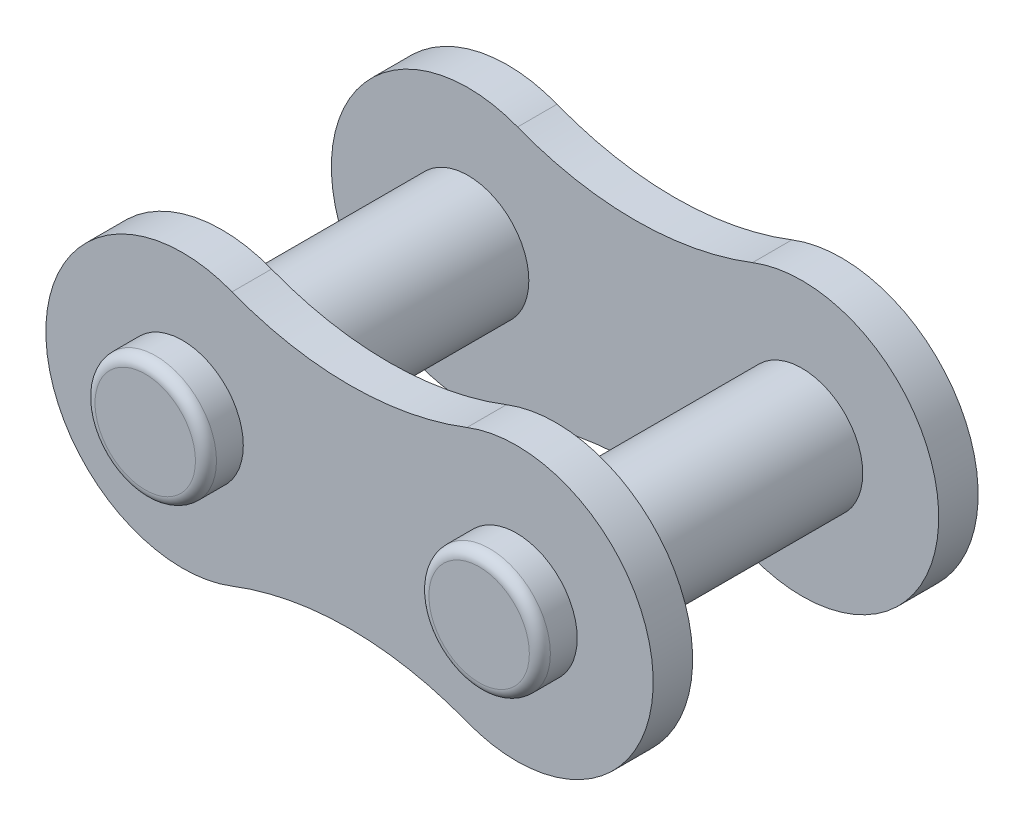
ISO-10303-21;
HEADER;
FILE_DESCRIPTION(('STEP AP214'),'2;1');
FILE_NAME('part.step','',(''),(''),'','','');
FILE_SCHEMA(('AUTOMOTIVE_DESIGN { 1 0 10303 214 1 1 1 1 }'));
ENDSEC;
DATA;
#1=APPLICATION_CONTEXT('core data for automotive mechanical design processes');
#2=APPLICATION_PROTOCOL_DEFINITION('international standard','automotive_design',2000,#1);
#3=PRODUCT_CONTEXT('',#1,'mechanical');
#4=PRODUCT('Part','Part','',(#3));
#5=PRODUCT_RELATED_PRODUCT_CATEGORY('part','',(#4));
#6=PRODUCT_DEFINITION_FORMATION('','',#4);
#7=PRODUCT_DEFINITION_CONTEXT('part definition',#1,'design');
#8=PRODUCT_DEFINITION('design','',#6,#7);
#9=PRODUCT_DEFINITION_SHAPE('','',#8);
#10=(LENGTH_UNIT() NAMED_UNIT(*) SI_UNIT(.MILLI.,.METRE.));
#11=(NAMED_UNIT(*) PLANE_ANGLE_UNIT() SI_UNIT($,.RADIAN.));
#12=(NAMED_UNIT(*) SI_UNIT($,.STERADIAN.) SOLID_ANGLE_UNIT());
#13=UNCERTAINTY_MEASURE_WITH_UNIT(LENGTH_MEASURE(1.E-05),#10,'distance_accuracy_value','');
#14=(GEOMETRIC_REPRESENTATION_CONTEXT(3) GLOBAL_UNCERTAINTY_ASSIGNED_CONTEXT((#13)) GLOBAL_UNIT_ASSIGNED_CONTEXT((#10,
#11,#12)) REPRESENTATION_CONTEXT('',''));
#15=CARTESIAN_POINT('',(0.,0.,0.));
#16=DIRECTION('',(0.,0.,1.));
#17=DIRECTION('',(1.,0.,0.));
#18=AXIS2_PLACEMENT_3D('',#15,#16,#17);
#19=CARTESIAN_POINT('',(3.175,8.17510091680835,3.09));
#20=DIRECTION('',(0.,0.,-1.));
#21=DIRECTION('',(-1.,0.,0.));
#22=AXIS2_PLACEMENT_3D('',#19,#20,#21);
#23=CYLINDRICAL_SURFACE('',#22,6.17);
#24=CARTESIAN_POINT('',(3.175,8.17510091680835,2.34));
#25=DIRECTION('',(0.,0.,1.));
#26=DIRECTION('',(-0.362029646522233,-0.932166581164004,0.));
#27=AXIS2_PLACEMENT_3D('',#24,#25,#26);
#28=CIRCLE('',#27,6.17);
#29=CARTESIAN_POINT('',(0.94127708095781,2.4236331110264,2.34));
#30=VERTEX_POINT('',#29);
#31=CARTESIAN_POINT('',(5.4087229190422,2.4236331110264,2.34));
#32=VERTEX_POINT('',#31);
#33=EDGE_CURVE('E90',#30,#32,#28,.T.);
#34=ORIENTED_EDGE('',*,*,#33,.F.);
#35=DIRECTION('',(0.,0.,-1.));
#36=VECTOR('',#35,1.);
#37=CARTESIAN_POINT('',(0.94127708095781,2.4236331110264,3.09));
#38=LINE('',#37,#36);
#39=CARTESIAN_POINT('',(0.94127708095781,2.4236331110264,3.09));
#40=VERTEX_POINT('',#39);
#41=EDGE_CURVE('E79',#40,#30,#38,.T.);
#42=ORIENTED_EDGE('',*,*,#41,.F.);
#43=CARTESIAN_POINT('',(3.175,8.17510091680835,3.09));
#44=DIRECTION('',(0.,0.,1.));
#45=DIRECTION('',(-0.362029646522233,-0.932166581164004,0.));
#46=AXIS2_PLACEMENT_3D('',#43,#44,#45);
#47=CIRCLE('',#46,6.17);
#48=CARTESIAN_POINT('',(5.4087229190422,2.4236331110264,3.09));
#49=VERTEX_POINT('',#48);
#50=EDGE_CURVE('E89',#40,#49,#47,.T.);
#51=ORIENTED_EDGE('',*,*,#50,.T.);
#52=DIRECTION('',(0.,0.,-1.));
#53=VECTOR('',#52,1.);
#54=CARTESIAN_POINT('',(5.4087229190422,2.4236331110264,3.09));
#55=LINE('',#54,#53);
#56=EDGE_CURVE('E101',#49,#32,#55,.T.);
#57=ORIENTED_EDGE('',*,*,#56,.T.);
#58=EDGE_LOOP('',(#34,#42,#51,#57));
#59=FACE_BOUND('',#58,.T.);
#60=ADVANCED_FACE('F15',(#59),#23,.F.);
#61=CARTESIAN_POINT('',(4.7625,4.08755045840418,2.34));
#62=DIRECTION('',(0.,0.,1.));
#63=DIRECTION('',(1.,0.,0.));
#64=AXIS2_PLACEMENT_3D('',#61,#62,#63);
#65=PLANE('',#64);
#66=CARTESIAN_POINT('',(6.35,0.,2.34));
#67=DIRECTION('',(0.,0.,-1.));
#68=DIRECTION('',(1.,0.,0.));
#69=AXIS2_PLACEMENT_3D('',#66,#67,#68);
#70=CIRCLE('',#69,1.155);
#71=CARTESIAN_POINT('',(7.505,0.,2.34));
#72=VERTEX_POINT('',#71);
#73=EDGE_CURVE('E112',#72,#72,#70,.T.);
#74=ORIENTED_EDGE('',*,*,#73,.F.);
#75=EDGE_LOOP('',(#74));
#76=FACE_BOUND('',#75,.T.);
#77=CARTESIAN_POINT('',(0.,0.,2.34));
#78=DIRECTION('',(0.,0.,-1.));
#79=DIRECTION('',(1.,0.,0.));
#80=AXIS2_PLACEMENT_3D('',#77,#78,#79);
#81=CIRCLE('',#80,1.155);
#82=CARTESIAN_POINT('',(1.155,0.,2.34));
#83=VERTEX_POINT('',#82);
#84=EDGE_CURVE('E117',#83,#83,#81,.T.);
#85=ORIENTED_EDGE('',*,*,#84,.F.);
#86=EDGE_LOOP('',(#85));
#87=FACE_BOUND('',#86,.T.);
#88=ORIENTED_EDGE('',*,*,#33,.T.);
#89=CARTESIAN_POINT('',(6.35,0.,2.34));
#90=DIRECTION('',(0.,0.,1.));
#91=DIRECTION('',(-0.362029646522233,-0.932166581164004,0.));
#92=AXIS2_PLACEMENT_3D('',#89,#90,#91);
#93=CIRCLE('',#92,2.6);
#94=CARTESIAN_POINT('',(5.4087229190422,-2.4236331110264,2.34));
#95=VERTEX_POINT('',#94);
#96=EDGE_CURVE('E120',#95,#32,#93,.T.);
#97=ORIENTED_EDGE('',*,*,#96,.F.);
#98=CARTESIAN_POINT('',(3.17500000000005,-8.17510091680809,2.34));
#99=DIRECTION('',(0.,0.,1.));
#100=DIRECTION('',(0.36202964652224,0.932166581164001,0.));
#101=AXIS2_PLACEMENT_3D('',#98,#99,#100);
#102=CIRCLE('',#101,6.16999999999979);
#103=CARTESIAN_POINT('',(0.941276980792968,-2.4236331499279,2.34));
#104=VERTEX_POINT('',#103);
#105=EDGE_CURVE('E97',#95,#104,#102,.T.);
#106=ORIENTED_EDGE('',*,*,#105,.T.);
#107=CARTESIAN_POINT('',(0.,0.,2.34));
#108=DIRECTION('',(0.,0.,1.));
#109=DIRECTION('',(0.36202964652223,0.932166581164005,0.));
#110=AXIS2_PLACEMENT_3D('',#107,#108,#109);
#111=CIRCLE('',#110,2.6);
#112=EDGE_CURVE('E83',#30,#104,#111,.T.);
#113=ORIENTED_EDGE('',*,*,#112,.F.);
#114=EDGE_LOOP('',(#88,#97,#106,#113));
#115=FACE_BOUND('',#114,.T.);
#116=ADVANCED_FACE('F95',(#76,#87,#115),#65,.F.);
#117=CARTESIAN_POINT('',(0.,0.,3.09));
#118=DIRECTION('',(0.,0.,-1.));
#119=DIRECTION('',(-1.,0.,0.));
#120=AXIS2_PLACEMENT_3D('',#117,#118,#119);
#121=CYLINDRICAL_SURFACE('',#120,2.6);
#122=ORIENTED_EDGE('',*,*,#112,.T.);
#123=DIRECTION('',(0.,0.,-1.));
#124=VECTOR('',#123,1.);
#125=CARTESIAN_POINT('',(0.941276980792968,-2.4236331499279,3.09));
#126=LINE('',#125,#124);
#127=CARTESIAN_POINT('',(0.941276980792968,-2.4236331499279,3.09));
#128=VERTEX_POINT('',#127);
#129=EDGE_CURVE('E98',#128,#104,#126,.T.);
#130=ORIENTED_EDGE('',*,*,#129,.F.);
#131=CARTESIAN_POINT('',(0.,0.,3.09));
#132=DIRECTION('',(0.,0.,1.));
#133=DIRECTION('',(0.36202964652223,0.932166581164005,0.));
#134=AXIS2_PLACEMENT_3D('',#131,#132,#133);
#135=CIRCLE('',#134,2.6);
#136=EDGE_CURVE('E85',#40,#128,#135,.T.);
#137=ORIENTED_EDGE('',*,*,#136,.F.);
#138=ORIENTED_EDGE('',*,*,#41,.T.);
#139=EDGE_LOOP('',(#122,#130,#137,#138));
#140=FACE_BOUND('',#139,.T.);
#141=ADVANCED_FACE('F81',(#140),#121,.T.);
#142=CARTESIAN_POINT('',(4.7625,4.08755045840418,3.09));
#143=DIRECTION('',(0.,0.,1.));
#144=DIRECTION('',(1.,0.,0.));
#145=AXIS2_PLACEMENT_3D('',#142,#143,#144);
#146=PLANE('',#145);
#147=CARTESIAN_POINT('',(6.35,0.,3.09));
#148=DIRECTION('',(0.,0.,-1.));
#149=DIRECTION('',(1.,0.,0.));
#150=AXIS2_PLACEMENT_3D('',#147,#148,#149);
#151=CIRCLE('',#150,1.155);
#152=CARTESIAN_POINT('',(7.505,0.,3.09));
#153=VERTEX_POINT('',#152);
#154=EDGE_CURVE('E133',#153,#153,#151,.T.);
#155=ORIENTED_EDGE('',*,*,#154,.T.);
#156=EDGE_LOOP('',(#155));
#157=FACE_BOUND('',#156,.T.);
#158=CARTESIAN_POINT('',(0.,0.,3.09));
#159=DIRECTION('',(0.,0.,-1.));
#160=DIRECTION('',(1.,0.,0.));
#161=AXIS2_PLACEMENT_3D('',#158,#159,#160);
#162=CIRCLE('',#161,1.155);
#163=CARTESIAN_POINT('',(1.155,0.,3.09));
#164=VERTEX_POINT('',#163);
#165=EDGE_CURVE('E138',#164,#164,#162,.T.);
#166=ORIENTED_EDGE('',*,*,#165,.T.);
#167=EDGE_LOOP('',(#166));
#168=FACE_BOUND('',#167,.T.);
#169=ORIENTED_EDGE('',*,*,#50,.F.);
#170=ORIENTED_EDGE('',*,*,#136,.T.);
#171=CARTESIAN_POINT('',(3.17500000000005,-8.17510091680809,3.09));
#172=DIRECTION('',(0.,0.,1.));
#173=DIRECTION('',(0.36202964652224,0.932166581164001,0.));
#174=AXIS2_PLACEMENT_3D('',#171,#172,#173);
#175=CIRCLE('',#174,6.16999999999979);
#176=CARTESIAN_POINT('',(5.4087229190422,-2.4236331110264,3.09));
#177=VERTEX_POINT('',#176);
#178=EDGE_CURVE('E141',#177,#128,#175,.T.);
#179=ORIENTED_EDGE('',*,*,#178,.F.);
#180=CARTESIAN_POINT('',(6.35,0.,3.09));
#181=DIRECTION('',(0.,0.,1.));
#182=DIRECTION('',(-0.362029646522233,-0.932166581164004,0.));
#183=AXIS2_PLACEMENT_3D('',#180,#181,#182);
#184=CIRCLE('',#183,2.6);
#185=EDGE_CURVE('E143',#177,#49,#184,.T.);
#186=ORIENTED_EDGE('',*,*,#185,.T.);
#187=EDGE_LOOP('',(#169,#170,#179,#186));
#188=FACE_BOUND('',#187,.T.);
#189=ADVANCED_FACE('F263',(#157,#168,#188),#146,.T.);
#190=CARTESIAN_POINT('',(6.35,0.,3.09));
#191=DIRECTION('',(0.,0.,-1.));
#192=DIRECTION('',(-1.,0.,0.));
#193=AXIS2_PLACEMENT_3D('',#190,#191,#192);
#194=CYLINDRICAL_SURFACE('',#193,2.6);
#195=ORIENTED_EDGE('',*,*,#96,.T.);
#196=ORIENTED_EDGE('',*,*,#56,.F.);
#197=ORIENTED_EDGE('',*,*,#185,.F.);
#198=DIRECTION('',(0.,0.,-1.));
#199=VECTOR('',#198,1.);
#200=CARTESIAN_POINT('',(5.4087229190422,-2.4236331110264,3.09));
#201=LINE('',#200,#199);
#202=EDGE_CURVE('E148',#177,#95,#201,.T.);
#203=ORIENTED_EDGE('',*,*,#202,.T.);
#204=EDGE_LOOP('',(#195,#196,#197,#203));
#205=FACE_BOUND('',#204,.T.);
#206=ADVANCED_FACE('F266',(#205),#194,.T.);
#207=CARTESIAN_POINT('',(6.35,0.,3.8));
#208=DIRECTION('',(0.,0.,1.));
#209=DIRECTION('',(1.,0.,0.));
#210=AXIS2_PLACEMENT_3D('',#207,#208,#209);
#211=CYLINDRICAL_SURFACE('',#210,1.155);
#212=ORIENTED_EDGE('',*,*,#73,.T.);
#213=EDGE_LOOP('',(#212));
#214=FACE_BOUND('',#213,.T.);
#215=CARTESIAN_POINT('',(6.35,0.,-2.34));
#216=DIRECTION('',(0.,0.,1.));
#217=DIRECTION('',(1.,0.,0.));
#218=AXIS2_PLACEMENT_3D('',#215,#216,#217);
#219=CIRCLE('',#218,1.155);
#220=CARTESIAN_POINT('',(7.505,0.,-2.34));
#221=VERTEX_POINT('',#220);
#222=EDGE_CURVE('E153',#221,#221,#219,.T.);
#223=ORIENTED_EDGE('',*,*,#222,.T.);
#224=EDGE_LOOP('',(#223));
#225=FACE_BOUND('',#224,.T.);
#226=ADVANCED_FACE('F270',(#214,#225),#211,.T.);
#227=CARTESIAN_POINT('',(0.,0.,3.8));
#228=DIRECTION('',(0.,0.,1.));
#229=DIRECTION('',(1.,0.,0.));
#230=AXIS2_PLACEMENT_3D('',#227,#228,#229);
#231=CYLINDRICAL_SURFACE('',#230,1.155);
#232=ORIENTED_EDGE('',*,*,#84,.T.);
#233=EDGE_LOOP('',(#232));
#234=FACE_BOUND('',#233,.T.);
#235=CARTESIAN_POINT('',(0.,0.,-2.34));
#236=DIRECTION('',(0.,0.,1.));
#237=DIRECTION('',(1.,0.,0.));
#238=AXIS2_PLACEMENT_3D('',#235,#236,#237);
#239=CIRCLE('',#238,1.155);
#240=CARTESIAN_POINT('',(1.155,0.,-2.34));
#241=VERTEX_POINT('',#240);
#242=EDGE_CURVE('E158',#241,#241,#239,.T.);
#243=ORIENTED_EDGE('',*,*,#242,.T.);
#244=EDGE_LOOP('',(#243));
#245=FACE_BOUND('',#244,.T.);
#246=ADVANCED_FACE('F274',(#234,#245),#231,.T.);
#247=CARTESIAN_POINT('',(3.17500000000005,-8.17510091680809,3.09));
#248=DIRECTION('',(0.,0.,-1.));
#249=DIRECTION('',(-1.,0.,0.));
#250=AXIS2_PLACEMENT_3D('',#247,#248,#249);
#251=CYLINDRICAL_SURFACE('',#250,6.16999999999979);
#252=ORIENTED_EDGE('',*,*,#105,.F.);
#253=ORIENTED_EDGE('',*,*,#202,.F.);
#254=ORIENTED_EDGE('',*,*,#178,.T.);
#255=ORIENTED_EDGE('',*,*,#129,.T.);
#256=EDGE_LOOP('',(#252,#253,#254,#255));
#257=FACE_BOUND('',#256,.T.);
#258=ADVANCED_FACE('F280',(#257),#251,.F.);
#259=CARTESIAN_POINT('',(6.35,0.,3.6));
#260=DIRECTION('',(0.,0.,1.));
#261=DIRECTION('',(1.,0.,0.));
#262=AXIS2_PLACEMENT_3D('',#259,#260,#261);
#263=CIRCLE('',#262,1.155);
#264=CARTESIAN_POINT('',(7.505,0.,3.6));
#265=VERTEX_POINT('',#264);
#266=EDGE_CURVE('E161',#265,#265,#263,.T.);
#267=ORIENTED_EDGE('',*,*,#266,.F.);
#268=EDGE_LOOP('',(#267));
#269=FACE_BOUND('',#268,.T.);
#270=ORIENTED_EDGE('',*,*,#154,.F.);
#271=EDGE_LOOP('',(#270));
#272=FACE_BOUND('',#271,.T.);
#273=ADVANCED_FACE('F277',(#269,#272),#211,.T.);
#274=CARTESIAN_POINT('',(0.,0.,3.6));
#275=DIRECTION('',(0.,0.,1.));
#276=DIRECTION('',(1.,0.,0.));
#277=AXIS2_PLACEMENT_3D('',#274,#275,#276);
#278=CIRCLE('',#277,1.155);
#279=CARTESIAN_POINT('',(1.155,0.,3.6));
#280=VERTEX_POINT('',#279);
#281=EDGE_CURVE('E164',#280,#280,#278,.T.);
#282=ORIENTED_EDGE('',*,*,#281,.F.);
#283=EDGE_LOOP('',(#282));
#284=FACE_BOUND('',#283,.T.);
#285=ORIENTED_EDGE('',*,*,#165,.F.);
#286=EDGE_LOOP('',(#285));
#287=FACE_BOUND('',#286,.T.);
#288=ADVANCED_FACE('F283',(#284,#287),#231,.T.);
#289=CARTESIAN_POINT('',(4.7625,4.08755045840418,-2.34));
#290=DIRECTION('',(0.,0.,1.));
#291=DIRECTION('',(1.,0.,0.));
#292=AXIS2_PLACEMENT_3D('',#289,#290,#291);
#293=PLANE('',#292);
#294=ORIENTED_EDGE('',*,*,#242,.F.);
#295=EDGE_LOOP('',(#294));
#296=FACE_BOUND('',#295,.T.);
#297=ORIENTED_EDGE('',*,*,#222,.F.);
#298=EDGE_LOOP('',(#297));
#299=FACE_BOUND('',#298,.T.);
#300=CARTESIAN_POINT('',(3.175,8.17510091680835,-2.34));
#301=DIRECTION('',(0.,0.,1.));
#302=DIRECTION('',(-0.362029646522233,-0.932166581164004,0.));
#303=AXIS2_PLACEMENT_3D('',#300,#301,#302);
#304=CIRCLE('',#303,6.17);
#305=CARTESIAN_POINT('',(0.94127708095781,2.4236331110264,-2.34));
#306=VERTEX_POINT('',#305);
#307=CARTESIAN_POINT('',(5.4087229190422,2.4236331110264,-2.34));
#308=VERTEX_POINT('',#307);
#309=EDGE_CURVE('E167',#306,#308,#304,.T.);
#310=ORIENTED_EDGE('',*,*,#309,.F.);
#311=CARTESIAN_POINT('',(0.,0.,-2.34));
#312=DIRECTION('',(0.,0.,1.));
#313=DIRECTION('',(0.36202964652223,0.932166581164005,0.));
#314=AXIS2_PLACEMENT_3D('',#311,#312,#313);
#315=CIRCLE('',#314,2.6);
#316=CARTESIAN_POINT('',(0.941276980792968,-2.4236331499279,-2.34));
#317=VERTEX_POINT('',#316);
#318=EDGE_CURVE('E170',#306,#317,#315,.T.);
#319=ORIENTED_EDGE('',*,*,#318,.T.);
#320=CARTESIAN_POINT('',(3.17500000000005,-8.17510091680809,-2.34));
#321=DIRECTION('',(0.,0.,1.));
#322=DIRECTION('',(0.36202964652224,0.932166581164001,0.));
#323=AXIS2_PLACEMENT_3D('',#320,#321,#322);
#324=CIRCLE('',#323,6.16999999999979);
#325=CARTESIAN_POINT('',(5.4087229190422,-2.4236331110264,-2.34));
#326=VERTEX_POINT('',#325);
#327=EDGE_CURVE('E175',#326,#317,#324,.T.);
#328=ORIENTED_EDGE('',*,*,#327,.F.);
#329=CARTESIAN_POINT('',(6.35,0.,-2.34));
#330=DIRECTION('',(0.,0.,1.));
#331=DIRECTION('',(-0.362029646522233,-0.932166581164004,0.));
#332=AXIS2_PLACEMENT_3D('',#329,#330,#331);
#333=CIRCLE('',#332,2.6);
#334=EDGE_CURVE('E179',#326,#308,#333,.T.);
#335=ORIENTED_EDGE('',*,*,#334,.T.);
#336=EDGE_LOOP('',(#310,#319,#328,#335));
#337=FACE_BOUND('',#336,.T.);
#338=ADVANCED_FACE('F287',(#296,#299,#337),#293,.T.);
#339=CARTESIAN_POINT('',(6.35,0.,3.6));
#340=DIRECTION('',(0.,0.,1.));
#341=DIRECTION('',(1.,0.,0.));
#342=AXIS2_PLACEMENT_3D('',#339,#340,#341);
#343=TOROIDAL_SURFACE('',#342,0.954999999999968,0.200000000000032);
#344=ORIENTED_EDGE('',*,*,#266,.T.);
#345=EDGE_LOOP('',(#344));
#346=FACE_BOUND('',#345,.T.);
#347=CARTESIAN_POINT('',(6.35,0.,3.8));
#348=DIRECTION('',(0.,0.,1.));
#349=DIRECTION('',(1.,0.,0.));
#350=AXIS2_PLACEMENT_3D('',#347,#348,#349);
#351=CIRCLE('',#350,0.955000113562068);
#352=CARTESIAN_POINT('',(7.30500011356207,0.,3.8));
#353=VERTEX_POINT('',#352);
#354=EDGE_CURVE('E184',#353,#353,#351,.T.);
#355=ORIENTED_EDGE('',*,*,#354,.F.);
#356=EDGE_LOOP('',(#355));
#357=FACE_BOUND('',#356,.T.);
#358=ADVANCED_FACE('F290',(#346,#357),#343,.T.);
#359=CARTESIAN_POINT('',(0.,0.,3.6));
#360=DIRECTION('',(0.,0.,1.));
#361=DIRECTION('',(1.,0.,0.));
#362=AXIS2_PLACEMENT_3D('',#359,#360,#361);
#363=TOROIDAL_SURFACE('',#362,0.954999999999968,0.200000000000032);
#364=ORIENTED_EDGE('',*,*,#281,.T.);
#365=EDGE_LOOP('',(#364));
#366=FACE_BOUND('',#365,.T.);
#367=CARTESIAN_POINT('',(0.,0.,3.8));
#368=DIRECTION('',(0.,0.,1.));
#369=DIRECTION('',(1.,0.,0.));
#370=AXIS2_PLACEMENT_3D('',#367,#368,#369);
#371=CIRCLE('',#370,0.955000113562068);
#372=CARTESIAN_POINT('',(0.955000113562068,0.,3.8));
#373=VERTEX_POINT('',#372);
#374=EDGE_CURVE('E189',#373,#373,#371,.T.);
#375=ORIENTED_EDGE('',*,*,#374,.F.);
#376=EDGE_LOOP('',(#375));
#377=FACE_BOUND('',#376,.T.);
#378=ADVANCED_FACE('F294',(#366,#377),#363,.T.);
#379=CARTESIAN_POINT('',(3.175,8.17510091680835,-3.09));
#380=DIRECTION('',(0.,0.,1.));
#381=DIRECTION('',(1.,0.,0.));
#382=AXIS2_PLACEMENT_3D('',#379,#380,#381);
#383=CYLINDRICAL_SURFACE('',#382,6.17);
#384=ORIENTED_EDGE('',*,*,#309,.T.);
#385=DIRECTION('',(0.,0.,1.));
#386=VECTOR('',#385,1.);
#387=CARTESIAN_POINT('',(5.4087229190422,2.4236331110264,-3.09));
#388=LINE('',#387,#386);
#389=CARTESIAN_POINT('',(5.4087229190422,2.4236331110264,-3.09));
#390=VERTEX_POINT('',#389);
#391=EDGE_CURVE('E192',#390,#308,#388,.T.);
#392=ORIENTED_EDGE('',*,*,#391,.F.);
#393=CARTESIAN_POINT('',(3.175,8.17510091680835,-3.09));
#394=DIRECTION('',(0.,0.,1.));
#395=DIRECTION('',(-0.362029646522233,-0.932166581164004,0.));
#396=AXIS2_PLACEMENT_3D('',#393,#394,#395);
#397=CIRCLE('',#396,6.17);
#398=CARTESIAN_POINT('',(0.94127708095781,2.4236331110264,-3.09));
#399=VERTEX_POINT('',#398);
#400=EDGE_CURVE('E194',#399,#390,#397,.T.);
#401=ORIENTED_EDGE('',*,*,#400,.F.);
#402=DIRECTION('',(0.,0.,1.));
#403=VECTOR('',#402,1.);
#404=CARTESIAN_POINT('',(0.94127708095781,2.4236331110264,-3.09));
#405=LINE('',#404,#403);
#406=EDGE_CURVE('E198',#399,#306,#405,.T.);
#407=ORIENTED_EDGE('',*,*,#406,.T.);
#408=EDGE_LOOP('',(#384,#392,#401,#407));
#409=FACE_BOUND('',#408,.T.);
#410=ADVANCED_FACE('F298',(#409),#383,.F.);
#411=CARTESIAN_POINT('',(0.,0.,-3.09));
#412=DIRECTION('',(0.,0.,1.));
#413=DIRECTION('',(1.,0.,0.));
#414=AXIS2_PLACEMENT_3D('',#411,#412,#413);
#415=CYLINDRICAL_SURFACE('',#414,2.6);
#416=ORIENTED_EDGE('',*,*,#318,.F.);
#417=ORIENTED_EDGE('',*,*,#406,.F.);
#418=CARTESIAN_POINT('',(0.,0.,-3.09));
#419=DIRECTION('',(0.,0.,1.));
#420=DIRECTION('',(0.36202964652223,0.932166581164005,0.));
#421=AXIS2_PLACEMENT_3D('',#418,#419,#420);
#422=CIRCLE('',#421,2.6);
#423=CARTESIAN_POINT('',(0.941276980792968,-2.4236331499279,-3.09));
#424=VERTEX_POINT('',#423);
#425=EDGE_CURVE('E203',#399,#424,#422,.T.);
#426=ORIENTED_EDGE('',*,*,#425,.T.);
#427=DIRECTION('',(0.,0.,1.));
#428=VECTOR('',#427,1.);
#429=CARTESIAN_POINT('',(0.941276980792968,-2.4236331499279,-3.09));
#430=LINE('',#429,#428);
#431=EDGE_CURVE('E207',#424,#317,#430,.T.);
#432=ORIENTED_EDGE('',*,*,#431,.T.);
#433=EDGE_LOOP('',(#416,#417,#426,#432));
#434=FACE_BOUND('',#433,.T.);
#435=ADVANCED_FACE('F302',(#434),#415,.T.);
#436=CARTESIAN_POINT('',(3.17500000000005,-8.17510091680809,-3.09));
#437=DIRECTION('',(0.,0.,1.));
#438=DIRECTION('',(1.,0.,0.));
#439=AXIS2_PLACEMENT_3D('',#436,#437,#438);
#440=CYLINDRICAL_SURFACE('',#439,6.16999999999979);
#441=ORIENTED_EDGE('',*,*,#327,.T.);
#442=ORIENTED_EDGE('',*,*,#431,.F.);
#443=CARTESIAN_POINT('',(3.17500000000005,-8.17510091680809,-3.09));
#444=DIRECTION('',(0.,0.,1.));
#445=DIRECTION('',(0.36202964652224,0.932166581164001,0.));
#446=AXIS2_PLACEMENT_3D('',#443,#444,#445);
#447=CIRCLE('',#446,6.16999999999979);
#448=CARTESIAN_POINT('',(5.4087229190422,-2.4236331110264,-3.09));
#449=VERTEX_POINT('',#448);
#450=EDGE_CURVE('E34',#449,#424,#447,.T.);
#451=ORIENTED_EDGE('',*,*,#450,.F.);
#452=DIRECTION('',(0.,0.,1.));
#453=VECTOR('',#452,1.);
#454=CARTESIAN_POINT('',(5.4087229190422,-2.4236331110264,-3.09));
#455=LINE('',#454,#453);
#456=EDGE_CURVE('E215',#449,#326,#455,.T.);
#457=ORIENTED_EDGE('',*,*,#456,.T.);
#458=EDGE_LOOP('',(#441,#442,#451,#457));
#459=FACE_BOUND('',#458,.T.);
#460=ADVANCED_FACE('F306',(#459),#440,.F.);
#461=CARTESIAN_POINT('',(6.35,0.,-3.09));
#462=DIRECTION('',(0.,0.,1.));
#463=DIRECTION('',(1.,0.,0.));
#464=AXIS2_PLACEMENT_3D('',#461,#462,#463);
#465=CYLINDRICAL_SURFACE('',#464,2.6);
#466=ORIENTED_EDGE('',*,*,#334,.F.);
#467=ORIENTED_EDGE('',*,*,#456,.F.);
#468=CARTESIAN_POINT('',(6.35,0.,-3.09));
#469=DIRECTION('',(0.,0.,1.));
#470=DIRECTION('',(-0.362029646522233,-0.932166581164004,0.));
#471=AXIS2_PLACEMENT_3D('',#468,#469,#470);
#472=CIRCLE('',#471,2.6);
#473=EDGE_CURVE('E30',#449,#390,#472,.T.);
#474=ORIENTED_EDGE('',*,*,#473,.T.);
#475=ORIENTED_EDGE('',*,*,#391,.T.);
#476=EDGE_LOOP('',(#466,#467,#474,#475));
#477=FACE_BOUND('',#476,.T.);
#478=ADVANCED_FACE('F310',(#477),#465,.T.);
#479=CARTESIAN_POINT('',(7.305,0.,3.8));
#480=DIRECTION('',(0.,0.,-1.));
#481=DIRECTION('',(-1.,0.,0.));
#482=AXIS2_PLACEMENT_3D('',#479,#480,#481);
#483=PLANE('',#482);
#484=ORIENTED_EDGE('',*,*,#354,.T.);
#485=EDGE_LOOP('',(#484));
#486=FACE_BOUND('',#485,.T.);
#487=ADVANCED_FACE('F314',(#486),#483,.F.);
#488=CARTESIAN_POINT('',(0.955,0.,3.8));
#489=DIRECTION('',(0.,0.,-1.));
#490=DIRECTION('',(-1.,0.,0.));
#491=AXIS2_PLACEMENT_3D('',#488,#489,#490);
#492=PLANE('',#491);
#493=ORIENTED_EDGE('',*,*,#374,.T.);
#494=EDGE_LOOP('',(#493));
#495=FACE_BOUND('',#494,.T.);
#496=ADVANCED_FACE('F318',(#495),#492,.F.);
#497=CARTESIAN_POINT('',(4.7625,4.08755045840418,-3.09));
#498=DIRECTION('',(0.,0.,1.));
#499=DIRECTION('',(1.,0.,0.));
#500=AXIS2_PLACEMENT_3D('',#497,#498,#499);
#501=PLANE('',#500);
#502=CARTESIAN_POINT('',(0.,0.,-3.09));
#503=DIRECTION('',(0.,0.,1.));
#504=DIRECTION('',(1.,0.,0.));
#505=AXIS2_PLACEMENT_3D('',#502,#503,#504);
#506=CIRCLE('',#505,1.155);
#507=CARTESIAN_POINT('',(1.155,0.,-3.09));
#508=VERTEX_POINT('',#507);
#509=EDGE_CURVE('E223',#508,#508,#506,.T.);
#510=ORIENTED_EDGE('',*,*,#509,.T.);
#511=EDGE_LOOP('',(#510));
#512=FACE_BOUND('',#511,.T.);
#513=CARTESIAN_POINT('',(6.35,0.,-3.09));
#514=DIRECTION('',(0.,0.,1.));
#515=DIRECTION('',(1.,0.,0.));
#516=AXIS2_PLACEMENT_3D('',#513,#514,#515);
#517=CIRCLE('',#516,1.155);
#518=CARTESIAN_POINT('',(7.505,0.,-3.09));
#519=VERTEX_POINT('',#518);
#520=EDGE_CURVE('E228',#519,#519,#517,.T.);
#521=ORIENTED_EDGE('',*,*,#520,.T.);
#522=EDGE_LOOP('',(#521));
#523=FACE_BOUND('',#522,.T.);
#524=ORIENTED_EDGE('',*,*,#400,.T.);
#525=ORIENTED_EDGE('',*,*,#473,.F.);
#526=ORIENTED_EDGE('',*,*,#450,.T.);
#527=ORIENTED_EDGE('',*,*,#425,.F.);
#528=EDGE_LOOP('',(#524,#525,#526,#527));
#529=FACE_BOUND('',#528,.T.);
#530=ADVANCED_FACE('F322',(#512,#523,#529),#501,.F.);
#531=ORIENTED_EDGE('',*,*,#509,.F.);
#532=EDGE_LOOP('',(#531));
#533=FACE_BOUND('',#532,.T.);
#534=CARTESIAN_POINT('',(0.,0.,-3.6));
#535=DIRECTION('',(0.,0.,1.));
#536=DIRECTION('',(1.,0.,0.));
#537=AXIS2_PLACEMENT_3D('',#534,#535,#536);
#538=CIRCLE('',#537,1.155);
#539=CARTESIAN_POINT('',(1.155,0.,-3.6));
#540=VERTEX_POINT('',#539);
#541=EDGE_CURVE('E231',#540,#540,#538,.T.);
#542=ORIENTED_EDGE('',*,*,#541,.T.);
#543=EDGE_LOOP('',(#542));
#544=FACE_BOUND('',#543,.T.);
#545=ADVANCED_FACE('F282',(#533,#544),#231,.T.);
#546=ORIENTED_EDGE('',*,*,#520,.F.);
#547=EDGE_LOOP('',(#546));
#548=FACE_BOUND('',#547,.T.);
#549=CARTESIAN_POINT('',(6.35,0.,-3.6));
#550=DIRECTION('',(0.,0.,1.));
#551=DIRECTION('',(1.,0.,0.));
#552=AXIS2_PLACEMENT_3D('',#549,#550,#551);
#553=CIRCLE('',#552,1.155);
#554=CARTESIAN_POINT('',(7.505,0.,-3.6));
#555=VERTEX_POINT('',#554);
#556=EDGE_CURVE('E234',#555,#555,#553,.T.);
#557=ORIENTED_EDGE('',*,*,#556,.T.);
#558=EDGE_LOOP('',(#557));
#559=FACE_BOUND('',#558,.T.);
#560=ADVANCED_FACE('F276',(#548,#559),#211,.T.);
#561=CARTESIAN_POINT('',(0.,0.,-3.6));
#562=DIRECTION('',(0.,0.,1.));
#563=DIRECTION('',(1.,0.,0.));
#564=AXIS2_PLACEMENT_3D('',#561,#562,#563);
#565=TOROIDAL_SURFACE('',#564,0.954999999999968,0.200000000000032);
#566=CARTESIAN_POINT('',(0.,0.,-3.8));
#567=DIRECTION('',(0.,0.,1.));
#568=DIRECTION('',(1.,0.,0.));
#569=AXIS2_PLACEMENT_3D('',#566,#567,#568);
#570=CIRCLE('',#569,0.955000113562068);
#571=CARTESIAN_POINT('',(0.955000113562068,0.,-3.8));
#572=VERTEX_POINT('',#571);
#573=EDGE_CURVE('E23',#572,#572,#570,.T.);
#574=ORIENTED_EDGE('',*,*,#573,.T.);
#575=EDGE_LOOP('',(#574));
#576=FACE_BOUND('',#575,.T.);
#577=ORIENTED_EDGE('',*,*,#541,.F.);
#578=EDGE_LOOP('',(#577));
#579=FACE_BOUND('',#578,.T.);
#580=ADVANCED_FACE('F239',(#576,#579),#565,.T.);
#581=CARTESIAN_POINT('',(6.35,0.,-3.6));
#582=DIRECTION('',(0.,0.,1.));
#583=DIRECTION('',(1.,0.,0.));
#584=AXIS2_PLACEMENT_3D('',#581,#582,#583);
#585=TOROIDAL_SURFACE('',#584,0.954999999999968,0.200000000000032);
#586=CARTESIAN_POINT('',(6.35,0.,-3.8));
#587=DIRECTION('',(0.,0.,1.));
#588=DIRECTION('',(1.,0.,0.));
#589=AXIS2_PLACEMENT_3D('',#586,#587,#588);
#590=CIRCLE('',#589,0.955000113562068);
#591=CARTESIAN_POINT('',(7.30500011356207,0.,-3.8));
#592=VERTEX_POINT('',#591);
#593=EDGE_CURVE('E10',#592,#592,#590,.T.);
#594=ORIENTED_EDGE('',*,*,#593,.T.);
#595=EDGE_LOOP('',(#594));
#596=FACE_BOUND('',#595,.T.);
#597=ORIENTED_EDGE('',*,*,#556,.F.);
#598=EDGE_LOOP('',(#597));
#599=FACE_BOUND('',#598,.T.);
#600=ADVANCED_FACE('F244',(#596,#599),#585,.T.);
#601=CARTESIAN_POINT('',(0.,0.,-3.8));
#602=DIRECTION('',(0.,0.,1.));
#603=DIRECTION('',(1.,0.,0.));
#604=AXIS2_PLACEMENT_3D('',#601,#602,#603);
#605=PLANE('',#604);
#606=ORIENTED_EDGE('',*,*,#573,.F.);
#607=EDGE_LOOP('',(#606));
#608=FACE_BOUND('',#607,.T.);
#609=ADVANCED_FACE('F242',(#608),#605,.F.);
#610=CARTESIAN_POINT('',(6.35,0.,-3.8));
#611=DIRECTION('',(0.,0.,1.));
#612=DIRECTION('',(1.,0.,0.));
#613=AXIS2_PLACEMENT_3D('',#610,#611,#612);
#614=PLANE('',#613);
#615=ORIENTED_EDGE('',*,*,#593,.F.);
#616=EDGE_LOOP('',(#615));
#617=FACE_BOUND('',#616,.T.);
#618=ADVANCED_FACE('F17',(#617),#614,.F.);
#619=CLOSED_SHELL('',(#60,#116,#141,#189,#206,#226,#246,#258,#273,#288,#338,#358,#378,#410,#435,
#460,#478,#487,#496,#530,#545,#560,#580,#600,#609,#618));
#620=MANIFOLD_SOLID_BREP('B1',#619);
#621=ADVANCED_BREP_SHAPE_REPRESENTATION('',(#18,#620),#14);
#622=SHAPE_DEFINITION_REPRESENTATION(#9,#621);
ENDSEC;
END-ISO-10303-21;
